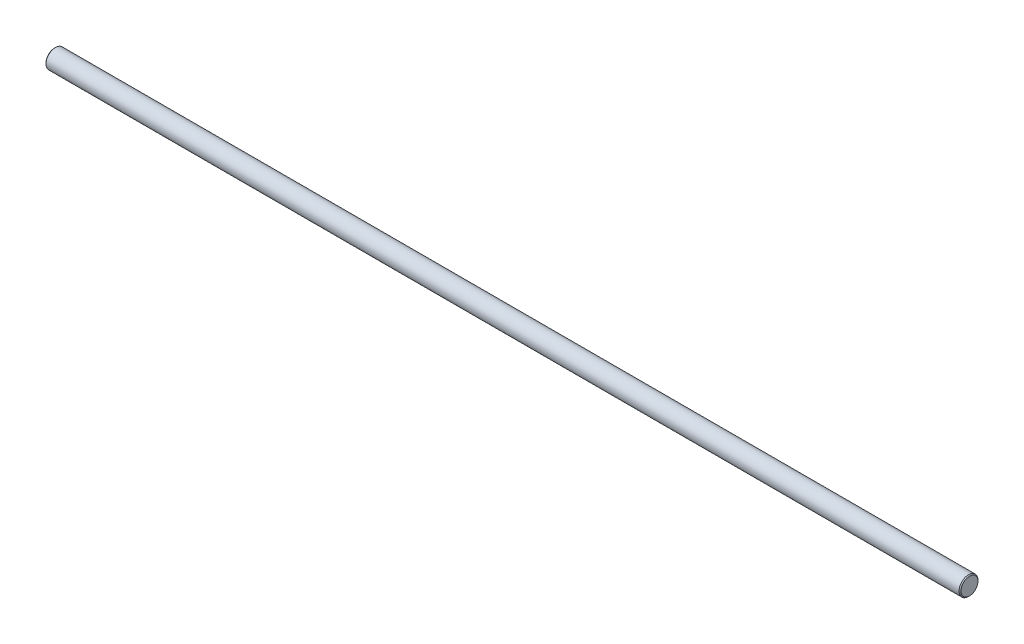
from build123d import *


with BuildPart() as part:
    # Sketch1 → Revolve1 (revolve)
    with BuildSketch(Plane.XY, mode=Mode.PRIVATE) as revolve1_sk:
        Polygon((0, 0), (0, 4.5), (0.5, 5), (482.5, 5), (483, 4.5), (483, 0), align=None)
    revolve(revolve1_sk.sketch.rotate(Axis((483, 0, 0), (-1, 0, 0)), 180), axis=Axis((483, 0, 0), (-1, 0, 0)))


solid = part.part
